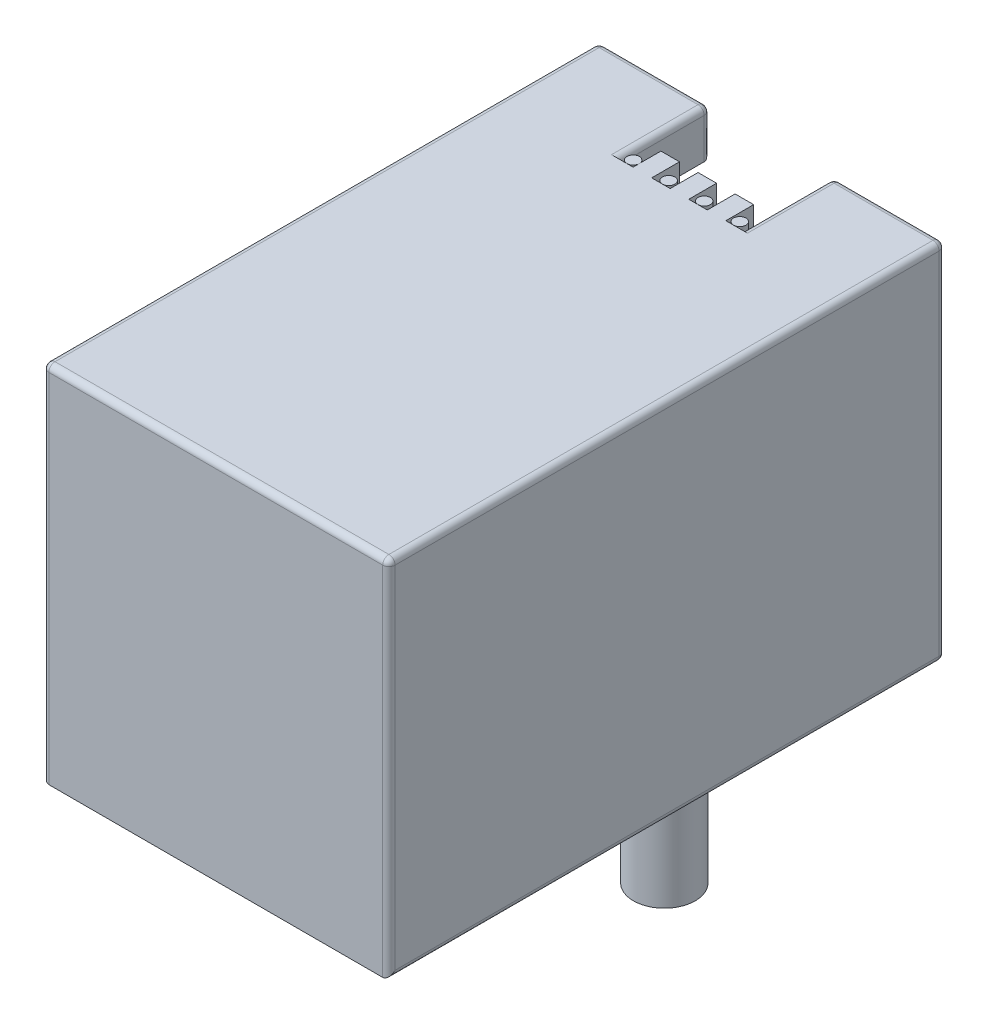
from build123d import *

# Parameters (mm, degrees)
SKETCH1_W          = 11.2
SKETCH1_H          = 11.75
EXTRUDE1_DEPTH     = 9
CUT_EXTRUDE1_DEPTH = 8
SKETCH3_R          = 1
EXTRUDE2_DEPTH     = 3.5
CUT_EXTRUDE2_DEPTH = 1.5
SKETCH6_W          = 4.7
SKETCH6_H          = 4.375
CUT_EXTRUDE3_DEPTH = 0.5
SKETCH7_W          = 0.5
SKETCH7_H          = 6.5625
SKETCH7_W_2        = 0.6
CUT_EXTRUDE4_DEPTH = 1
SKETCH10_R         = 0.2
LPATTERN2_COUNT    = 4
LPATTERN2_PITCH    = 1.15
FILLET1_R          = 0.2


with BuildPart() as part:
    # Sketch1 → Extrude1 (new, symmetric)
    with BuildSketch(Plane.XY):
        Rectangle(SKETCH1_W, SKETCH1_H)
    extrude(amount=EXTRUDE1_DEPTH, both=True)

    # Sketch2 → Cut-Extrude1 (cut)
    with BuildSketch(Plane(origin=(0, 0, -9), x_dir=(-1, 0, 0), z_dir=(0, 0, -1))):
        Polygon((-4.1, 4.375), (-4.1, -3.625), (-2.85, -3.625), (-2.85, -4.875), (-1.5, -4.875), (-1.5, -5.875), (1.5, -5.875), (1.5, -4.875), (2.85, -4.875), (2.85, -3.625), (4.1, -3.625), (4.1, 4.375), align=None)
    extrude(amount=-CUT_EXTRUDE1_DEPTH, mode=Mode.SUBTRACT)

    # Sketch3 → Extrude2 (add)
    with BuildSketch(Plane.XZ.offset(5.875)):
        with Locations(Location((-3.81, -1.7, 0), (0, 0, 90))):
            Circle(SKETCH3_R)
        with Locations(Location((3.81, -1.7, 0), (0, 0, 90))):
            Circle(SKETCH3_R)
    extrude(amount=EXTRUDE2_DEPTH)

    # Sketch4 → Cut-Extrude2 (cut)
    with BuildSketch(Plane.XZ.offset(-4.375)):
        Polygon((-0.3, -6.9), (-0.3, -6), (-0.9, -6), (-0.9, -6.9), (-1.5, -6.9), (-1.5, -6), (-2, -6), (-2, -9), (2, -9), (2, -6), (1.5, -6), (1.5, -6.9), (0.9, -6.9), (0.9, -6), (0.3, -6), (0.3, -6.9), align=None)
    extrude(amount=-CUT_EXTRUDE2_DEPTH, mode=Mode.SUBTRACT)

    # Sketch6 → Cut-Extrude3 (cut)
    with BuildSketch(Plane(origin=(0, 0, -1), x_dir=(-1, 0, 0), z_dir=(0, 0, -1))):
        with Locations((0, -2.1875)):
            Rectangle(SKETCH6_W, SKETCH6_H)
    extrude(amount=-CUT_EXTRUDE3_DEPTH, mode=Mode.SUBTRACT)

    # Sketch7 → Cut-Extrude4 (cut)
    with BuildSketch(Plane(origin=(0, 0, -1), x_dir=(-1, 0, 0), z_dir=(0, 0, -1))):
        with Locations((1.75, 1.09375)):
            Rectangle(SKETCH7_W, SKETCH7_H)
        with Locations((0.6, 1.09375)):
            Rectangle(SKETCH7_W_2, SKETCH7_H)
        with Locations((-0.6, 1.09375)):
            Rectangle(SKETCH7_W_2, SKETCH7_H)
        with Locations((-1.75, 1.09375)):
            Rectangle(SKETCH7_W, SKETCH7_H)
    extrude(amount=-CUT_EXTRUDE4_DEPTH, mode=Mode.SUBTRACT)

    # Fillet1
    fillet1_edges = [part.edges().sort_by_distance(p)[0] for p in [
        (5.6, 0, 9),
        (0, 5.875, 9),
        (3.55, -5.875, -9),
        (2.85, -3.625, -5),
        (4.1, -3.625, -5),
        (-4.1, -3.625, -5),
        (-2.85, -3.625, -5),
        (-2.85, -4.875, -5),
        (-1.5, -4.875, -5),
        (0, -5.875, -1),
        (-1.5, -5.875, -5),
        (1.5, -5.875, -5),
        (1.5, -4.875, -5),
        (2.85, -4.875, -5),
        (3.475, -3.625, -9),
        (2.85, -4.25, -9),
        (2.175, -4.875, -9),
        (1.5, -5.375, -9),
        (-1.5, -5.375, -9),
        (-2.175, -4.875, -9),
        (-2.85, -4.25, -9),
        (-3.475, -3.625, -9),
        (-4.1, 0.375, -9),
        (-3.05, 4.375, -9),
        (4.1, 0.375, -9),
        (-5.6, 0, 9),
        (3.8, 5.875, -9),
        (5.6, 0, -9),
        (-3.55, -5.875, -9),
        (-5.6, 0, -9),
        (3.05, 4.375, -9),
        (-3.8, 5.875, -9),
        (-5.6, 5.875, 0),
        (5.6, 5.875, 0),
        (5.6, -5.875, 0),
        (2, 5.125, -9),
        (-2, 5.875, -7.5),
        (-2, 5.125, -9),
        (-5.6, -5.875, 0),
        (2, 5.875, -7.5),
    ]]
    fillet(fillet1_edges, radius=FILLET1_R)


with BuildPart() as body_2:
    # Sweep1: sweep along a path in Sketch9
    with BuildLine(Plane(origin=(1.75, 0, 0), x_dir=(0, 0, -1), z_dir=(1, 0, 0))) as sweep1_path:
        Line((6, 5.875), (6, 4.375))
        ThreePointArc((6, 4.375), (5.953208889, 4.246442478), (5.834729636, 4.178038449))
        Line((5.834729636, 4.178038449), (0, 3.14921819))
    # Sketch10 → Sweep1 (sweep)
    with BuildSketch(Plane(origin=(0, 5.875, 0), x_dir=(1, 0, 0), z_dir=(0, 1, 0))):
        with Locations((1.75, 6.2)):
            Circle(SKETCH10_R)
    sweep(path=sweep1_path.line)


with BuildPart() as lpattern2_1:
    # LPattern2: pattern copy
    add(body_2.part.moved(Location(Vector(-1, 0, 0) * (1 * LPATTERN2_PITCH))))


with BuildPart() as lpattern2_2:
    # LPattern2: pattern copy
    add(body_2.part.moved(Location(Vector(-1, 0, 0) * (2 * LPATTERN2_PITCH))))


with BuildPart() as lpattern2_3:
    # LPattern2: pattern copy
    add(body_2.part.moved(Location(Vector(-1, 0, 0) * (3 * LPATTERN2_PITCH))))


solid = Compound([part.part, body_2.part, lpattern2_1.part, lpattern2_2.part, lpattern2_3.part])
